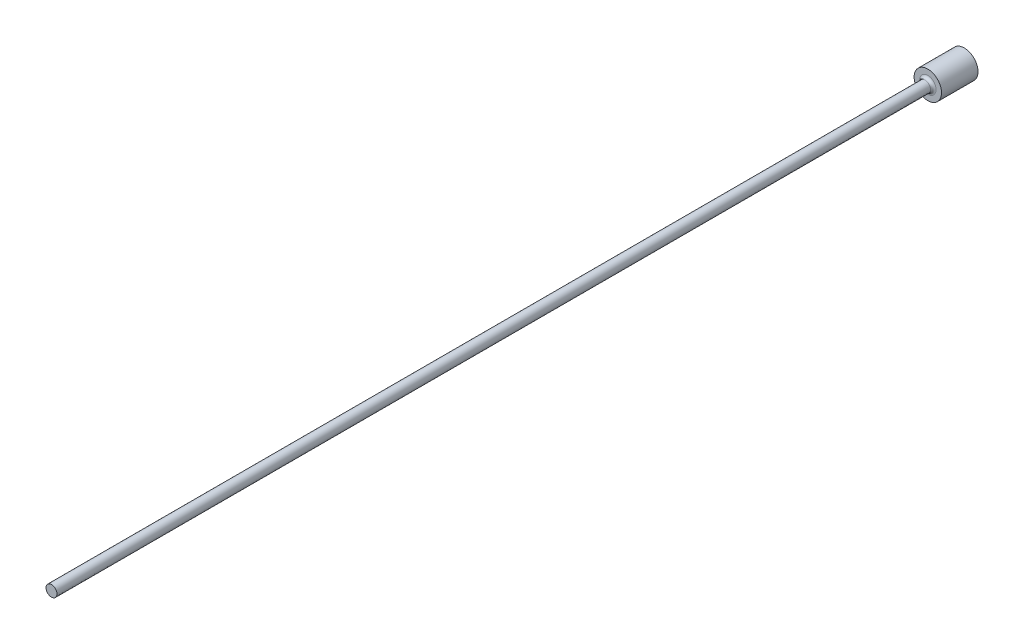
from build123d import *

# Parameters (mm, degrees)
FILLET1_R = 0.3


with BuildPart() as part:
    # FV → Revolve1 (revolve)
    with BuildSketch(Plane(origin=(0, 0, 0), x_dir=(1, 0, 0), z_dir=(0, 1, 0)), mode=Mode.PRIVATE) as revolve1_sk:
        Polygon((0, 0), (1.5, 0), (1.5, -4), (0.6, -4), (0.6, -100), (0, -100), align=None)
    revolve(revolve1_sk.sketch.rotate(Axis((0, 0, -9.033228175), (0, 0, 1)), 180), axis=Axis((0, 0, -9.033228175), (0, 0, 1)))

    # Fillet1
    fillet1_edges = [part.edges().sort_by_distance(p)[0] for p in [
        (0.6, 0, 4),
    ]]
    fillet(fillet1_edges, radius=FILLET1_R)


solid = part.part
